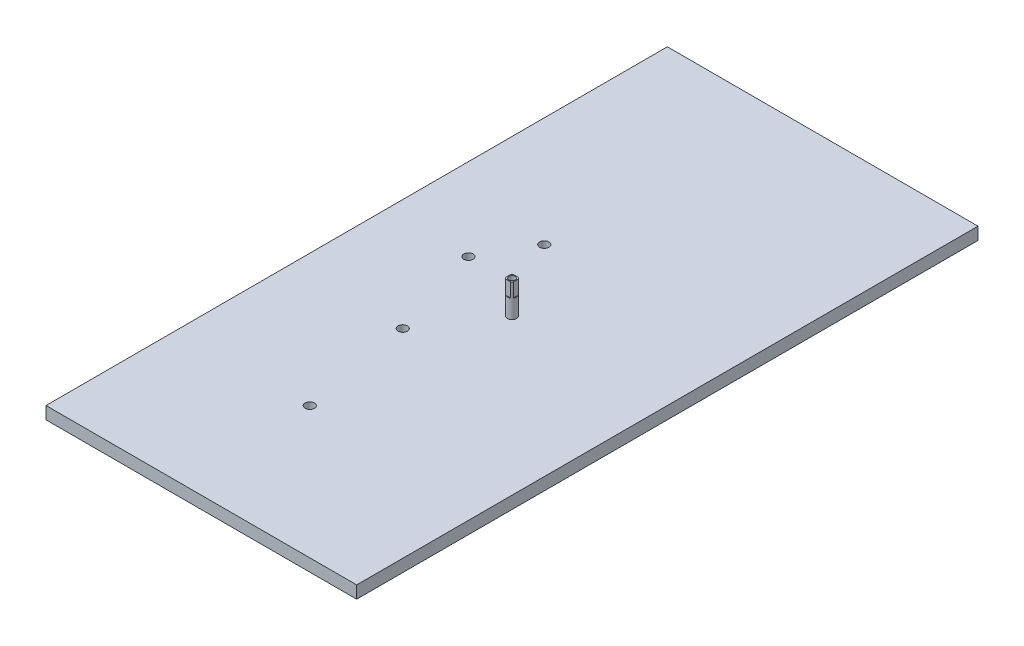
ISO-10303-21;
HEADER;
FILE_DESCRIPTION(('STEP AP214'),'2;1');
FILE_NAME('part.step','',(''),(''),'','','');
FILE_SCHEMA(('AUTOMOTIVE_DESIGN { 1 0 10303 214 1 1 1 1 }'));
ENDSEC;
DATA;
#1=APPLICATION_CONTEXT('core data for automotive mechanical design processes');
#2=APPLICATION_PROTOCOL_DEFINITION('international standard','automotive_design',2000,#1);
#3=PRODUCT_CONTEXT('',#1,'mechanical');
#4=PRODUCT('Part','Part','',(#3));
#5=PRODUCT_RELATED_PRODUCT_CATEGORY('part','',(#4));
#6=PRODUCT_DEFINITION_FORMATION('','',#4);
#7=PRODUCT_DEFINITION_CONTEXT('part definition',#1,'design');
#8=PRODUCT_DEFINITION('design','',#6,#7);
#9=PRODUCT_DEFINITION_SHAPE('','',#8);
#10=(LENGTH_UNIT() NAMED_UNIT(*) SI_UNIT(.MILLI.,.METRE.));
#11=(NAMED_UNIT(*) PLANE_ANGLE_UNIT() SI_UNIT($,.RADIAN.));
#12=(NAMED_UNIT(*) SI_UNIT($,.STERADIAN.) SOLID_ANGLE_UNIT());
#13=UNCERTAINTY_MEASURE_WITH_UNIT(LENGTH_MEASURE(1.E-05),#10,'distance_accuracy_value','');
#14=(GEOMETRIC_REPRESENTATION_CONTEXT(3) GLOBAL_UNCERTAINTY_ASSIGNED_CONTEXT((#13)) GLOBAL_UNIT_ASSIGNED_CONTEXT((#10,
#11,#12)) REPRESENTATION_CONTEXT('',''));
#15=CARTESIAN_POINT('',(0.,0.,0.));
#16=DIRECTION('',(0.,0.,1.));
#17=DIRECTION('',(1.,0.,0.));
#18=AXIS2_PLACEMENT_3D('',#15,#16,#17);
#19=CARTESIAN_POINT('',(0.,14.5,0.));
#20=DIRECTION('',(0.,1.,0.));
#21=DIRECTION('',(0.,0.,1.));
#22=AXIS2_PLACEMENT_3D('',#19,#20,#21);
#23=PLANE('',#22);
#24=CARTESIAN_POINT('',(0.,14.5,0.));
#25=DIRECTION('',(0.,1.,0.));
#26=DIRECTION('',(0.,0.,1.));
#27=AXIS2_PLACEMENT_3D('',#24,#25,#26);
#28=CIRCLE('',#27,1.);
#29=CARTESIAN_POINT('',(0.,14.5,1.));
#30=VERTEX_POINT('',#29);
#31=EDGE_CURVE('E148',#30,#30,#28,.T.);
#32=ORIENTED_EDGE('',*,*,#31,.F.);
#33=EDGE_LOOP('',(#32));
#34=FACE_BOUND('',#33,.T.);
#35=CARTESIAN_POINT('',(0.,14.5,0.));
#36=DIRECTION('',(0.,1.,0.));
#37=DIRECTION('',(0.,0.,1.));
#38=AXIS2_PLACEMENT_3D('',#35,#36,#37);
#39=CIRCLE('',#38,1.5);
#40=CARTESIAN_POINT('',(-0.829156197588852,14.5,-1.25));
#41=VERTEX_POINT('',#40);
#42=CARTESIAN_POINT('',(-1.25,14.5,-0.82915619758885));
#43=VERTEX_POINT('',#42);
#44=EDGE_CURVE('E147',#41,#43,#39,.T.);
#45=ORIENTED_EDGE('',*,*,#44,.T.);
#46=DIRECTION('',(0.,0.,1.));
#47=VECTOR('',#46,1.);
#48=CARTESIAN_POINT('',(-1.25,14.5,-1.25));
#49=LINE('',#48,#47);
#50=CARTESIAN_POINT('',(-1.25,14.5,0.82915619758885));
#51=VERTEX_POINT('',#50);
#52=EDGE_CURVE('E132',#43,#51,#49,.T.);
#53=ORIENTED_EDGE('',*,*,#52,.T.);
#54=CARTESIAN_POINT('',(-0.82915619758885,14.5,1.25));
#55=VERTEX_POINT('',#54);
#56=EDGE_CURVE('E140',#51,#55,#39,.T.);
#57=ORIENTED_EDGE('',*,*,#56,.T.);
#58=DIRECTION('',(1.,0.,0.));
#59=VECTOR('',#58,1.);
#60=CARTESIAN_POINT('',(1.25,14.5,1.25));
#61=LINE('',#60,#59);
#62=CARTESIAN_POINT('',(0.82915619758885,14.5,1.25));
#63=VERTEX_POINT('',#62);
#64=EDGE_CURVE('E120',#55,#63,#61,.T.);
#65=ORIENTED_EDGE('',*,*,#64,.T.);
#66=CARTESIAN_POINT('',(1.25,14.5,0.829156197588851));
#67=VERTEX_POINT('',#66);
#68=EDGE_CURVE('E150',#63,#67,#39,.T.);
#69=ORIENTED_EDGE('',*,*,#68,.T.);
#70=DIRECTION('',(0.,0.,-1.));
#71=VECTOR('',#70,1.);
#72=CARTESIAN_POINT('',(1.25,14.5,-1.25));
#73=LINE('',#72,#71);
#74=CARTESIAN_POINT('',(1.25,14.5,-0.829156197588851));
#75=VERTEX_POINT('',#74);
#76=EDGE_CURVE('E131',#67,#75,#73,.T.);
#77=ORIENTED_EDGE('',*,*,#76,.T.);
#78=CARTESIAN_POINT('',(0.829156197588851,14.5,-1.25));
#79=VERTEX_POINT('',#78);
#80=EDGE_CURVE('E151',#75,#79,#39,.T.);
#81=ORIENTED_EDGE('',*,*,#80,.T.);
#82=DIRECTION('',(-1.,0.,0.));
#83=VECTOR('',#82,1.);
#84=CARTESIAN_POINT('',(1.25,14.5,-1.25));
#85=LINE('',#84,#83);
#86=EDGE_CURVE('E162',#79,#41,#85,.T.);
#87=ORIENTED_EDGE('',*,*,#86,.T.);
#88=EDGE_LOOP('',(#45,#53,#57,#65,#69,#77,#81,#87));
#89=FACE_BOUND('',#88,.T.);
#90=ADVANCED_FACE('F33',(#34,#89),#23,.T.);
#91=CARTESIAN_POINT('',(0.,14.5,0.));
#92=DIRECTION('',(0.,-1.,0.));
#93=DIRECTION('',(0.,0.,-1.));
#94=AXIS2_PLACEMENT_3D('',#91,#92,#93);
#95=CYLINDRICAL_SURFACE('',#94,1.5);
#96=CARTESIAN_POINT('',(0.,4.,0.));
#97=DIRECTION('',(0.,-1.,0.));
#98=DIRECTION('',(0.,0.,-1.));
#99=AXIS2_PLACEMENT_3D('',#96,#97,#98);
#100=CIRCLE('',#99,1.5);
#101=CARTESIAN_POINT('',(0.,4.,-1.5));
#102=VERTEX_POINT('',#101);
#103=EDGE_CURVE('E182',#102,#102,#100,.F.);
#104=ORIENTED_EDGE('',*,*,#103,.T.);
#105=EDGE_LOOP('',(#104));
#106=FACE_BOUND('',#105,.T.);
#107=DIRECTION('',(0.,-1.,0.));
#108=VECTOR('',#107,1.);
#109=CARTESIAN_POINT('',(-1.25,14.5,-0.82915619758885));
#110=LINE('',#109,#108);
#111=CARTESIAN_POINT('',(-1.25,10.,-0.82915619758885));
#112=VERTEX_POINT('',#111);
#113=EDGE_CURVE('E11',#43,#112,#110,.T.);
#114=ORIENTED_EDGE('',*,*,#113,.F.);
#115=ORIENTED_EDGE('',*,*,#44,.F.);
#116=DIRECTION('',(0.,-1.,0.));
#117=VECTOR('',#116,1.);
#118=CARTESIAN_POINT('',(-0.829156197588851,14.5,-1.25));
#119=LINE('',#118,#117);
#120=CARTESIAN_POINT('',(-0.829156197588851,10.,-1.25));
#121=VERTEX_POINT('',#120);
#122=EDGE_CURVE('E173',#121,#41,#119,.F.);
#123=ORIENTED_EDGE('',*,*,#122,.F.);
#124=CARTESIAN_POINT('',(0.,10.,0.));
#125=DIRECTION('',(0.,-1.,0.));
#126=DIRECTION('',(0.,0.,-1.));
#127=AXIS2_PLACEMENT_3D('',#124,#125,#126);
#128=CIRCLE('',#127,1.5);
#129=CARTESIAN_POINT('',(0.829156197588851,10.,-1.25));
#130=VERTEX_POINT('',#129);
#131=EDGE_CURVE('E170',#121,#130,#128,.T.);
#132=ORIENTED_EDGE('',*,*,#131,.T.);
#133=DIRECTION('',(0.,-1.,0.));
#134=VECTOR('',#133,1.);
#135=CARTESIAN_POINT('',(0.829156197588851,14.5,-1.25));
#136=LINE('',#135,#134);
#137=EDGE_CURVE('E168',#79,#130,#136,.T.);
#138=ORIENTED_EDGE('',*,*,#137,.F.);
#139=ORIENTED_EDGE('',*,*,#80,.F.);
#140=DIRECTION('',(0.,-1.,0.));
#141=VECTOR('',#140,1.);
#142=CARTESIAN_POINT('',(1.25,14.5,-0.829156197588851));
#143=LINE('',#142,#141);
#144=CARTESIAN_POINT('',(1.25,10.,-0.829156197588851));
#145=VERTEX_POINT('',#144);
#146=EDGE_CURVE('E143',#145,#75,#143,.F.);
#147=ORIENTED_EDGE('',*,*,#146,.F.);
#148=CARTESIAN_POINT('',(1.25,10.,0.829156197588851));
#149=VERTEX_POINT('',#148);
#150=EDGE_CURVE('E175',#145,#149,#128,.T.);
#151=ORIENTED_EDGE('',*,*,#150,.T.);
#152=DIRECTION('',(0.,-1.,0.));
#153=VECTOR('',#152,1.);
#154=CARTESIAN_POINT('',(1.25,14.5,0.829156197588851));
#155=LINE('',#154,#153);
#156=EDGE_CURVE('E178',#67,#149,#155,.T.);
#157=ORIENTED_EDGE('',*,*,#156,.F.);
#158=ORIENTED_EDGE('',*,*,#68,.F.);
#159=DIRECTION('',(0.,-1.,0.));
#160=VECTOR('',#159,1.);
#161=CARTESIAN_POINT('',(0.82915619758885,14.5,1.25));
#162=LINE('',#161,#160);
#163=CARTESIAN_POINT('',(0.82915619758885,10.,1.25));
#164=VERTEX_POINT('',#163);
#165=EDGE_CURVE('E126',#164,#63,#162,.F.);
#166=ORIENTED_EDGE('',*,*,#165,.F.);
#167=CARTESIAN_POINT('',(-0.82915619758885,10.,1.25));
#168=VERTEX_POINT('',#167);
#169=EDGE_CURVE('E142',#164,#168,#128,.T.);
#170=ORIENTED_EDGE('',*,*,#169,.T.);
#171=DIRECTION('',(0.,-1.,0.));
#172=VECTOR('',#171,1.);
#173=CARTESIAN_POINT('',(-0.82915619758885,14.5,1.25));
#174=LINE('',#173,#172);
#175=EDGE_CURVE('E123',#55,#168,#174,.T.);
#176=ORIENTED_EDGE('',*,*,#175,.F.);
#177=ORIENTED_EDGE('',*,*,#56,.F.);
#178=DIRECTION('',(0.,-1.,0.));
#179=VECTOR('',#178,1.);
#180=CARTESIAN_POINT('',(-1.25,14.5,0.82915619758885));
#181=LINE('',#180,#179);
#182=CARTESIAN_POINT('',(-1.25,10.,0.82915619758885));
#183=VERTEX_POINT('',#182);
#184=EDGE_CURVE('E171',#183,#51,#181,.F.);
#185=ORIENTED_EDGE('',*,*,#184,.F.);
#186=EDGE_CURVE('E41',#183,#112,#128,.T.);
#187=ORIENTED_EDGE('',*,*,#186,.T.);
#188=EDGE_LOOP('',(#114,#115,#123,#132,#138,#139,#147,#151,#157,#158,#166,#170,#176,#177,#185,#187));
#189=FACE_BOUND('',#188,.T.);
#190=ADVANCED_FACE('F138',(#106,#189),#95,.T.);
#191=CARTESIAN_POINT('',(0.,4.,0.));
#192=DIRECTION('',(0.,-1.,0.));
#193=DIRECTION('',(0.,0.,-1.));
#194=AXIS2_PLACEMENT_3D('',#191,#192,#193);
#195=PLANE('',#194);
#196=DIRECTION('',(0.,0.,-1.));
#197=VECTOR('',#196,1.);
#198=CARTESIAN_POINT('',(50.,4.,100.));
#199=LINE('',#198,#197);
#200=CARTESIAN_POINT('',(50.,4.,100.));
#201=VERTEX_POINT('',#200);
#202=CARTESIAN_POINT('',(50.,4.,-100.));
#203=VERTEX_POINT('',#202);
#204=EDGE_CURVE('E200',#201,#203,#199,.T.);
#205=ORIENTED_EDGE('',*,*,#204,.T.);
#206=DIRECTION('',(-1.,0.,0.));
#207=VECTOR('',#206,1.);
#208=CARTESIAN_POINT('',(-50.,4.,-100.));
#209=LINE('',#208,#207);
#210=CARTESIAN_POINT('',(-50.,4.,-100.));
#211=VERTEX_POINT('',#210);
#212=EDGE_CURVE('E212',#203,#211,#209,.T.);
#213=ORIENTED_EDGE('',*,*,#212,.T.);
#214=DIRECTION('',(0.,0.,1.));
#215=VECTOR('',#214,1.);
#216=CARTESIAN_POINT('',(-50.,4.,100.));
#217=LINE('',#216,#215);
#218=CARTESIAN_POINT('',(-50.,4.,100.));
#219=VERTEX_POINT('',#218);
#220=EDGE_CURVE('E210',#211,#219,#217,.T.);
#221=ORIENTED_EDGE('',*,*,#220,.T.);
#222=DIRECTION('',(1.,0.,0.));
#223=VECTOR('',#222,1.);
#224=CARTESIAN_POINT('',(-50.,4.,100.));
#225=LINE('',#224,#223);
#226=EDGE_CURVE('E197',#219,#201,#225,.T.);
#227=ORIENTED_EDGE('',*,*,#226,.T.);
#228=EDGE_LOOP('',(#205,#213,#221,#227));
#229=FACE_BOUND('',#228,.T.);
#230=CARTESIAN_POINT('',(-14.666351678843,4.,-25.0632547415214));
#231=DIRECTION('',(0.,1.,0.));
#232=DIRECTION('',(0.,0.,1.));
#233=AXIS2_PLACEMENT_3D('',#230,#231,#232);
#234=CIRCLE('',#233,1.5);
#235=CARTESIAN_POINT('',(-14.666351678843,4.,-23.5632547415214));
#236=VERTEX_POINT('',#235);
#237=EDGE_CURVE('E275',#236,#236,#234,.T.);
#238=ORIENTED_EDGE('',*,*,#237,.F.);
#239=EDGE_LOOP('',(#238));
#240=FACE_BOUND('',#239,.T.);
#241=CARTESIAN_POINT('',(-23.5191286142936,4.,-9.5));
#242=DIRECTION('',(0.,1.,0.));
#243=DIRECTION('',(0.,0.,1.));
#244=AXIS2_PLACEMENT_3D('',#241,#242,#243);
#245=CIRCLE('',#244,1.5);
#246=CARTESIAN_POINT('',(-23.5191286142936,4.,-8.));
#247=VERTEX_POINT('',#246);
#248=EDGE_CURVE('E279',#247,#247,#245,.T.);
#249=ORIENTED_EDGE('',*,*,#248,.F.);
#250=EDGE_LOOP('',(#249));
#251=FACE_BOUND('',#250,.T.);
#252=CARTESIAN_POINT('',(-14.044290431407,4.,21.1224363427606));
#253=DIRECTION('',(0.,1.,0.));
#254=DIRECTION('',(0.,0.,1.));
#255=AXIS2_PLACEMENT_3D('',#252,#253,#254);
#256=CIRCLE('',#255,1.5);
#257=CARTESIAN_POINT('',(-14.044290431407,4.,22.6224363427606));
#258=VERTEX_POINT('',#257);
#259=EDGE_CURVE('E285',#258,#258,#256,.T.);
#260=ORIENTED_EDGE('',*,*,#259,.F.);
#261=EDGE_LOOP('',(#260));
#262=FACE_BOUND('',#261,.T.);
#263=CARTESIAN_POINT('',(-7.49755196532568,4.,57.5927572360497));
#264=DIRECTION('',(0.,1.,0.));
#265=DIRECTION('',(0.,0.,1.));
#266=AXIS2_PLACEMENT_3D('',#263,#264,#265);
#267=CIRCLE('',#266,1.5);
#268=CARTESIAN_POINT('',(-7.49755196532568,4.,59.0927572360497));
#269=VERTEX_POINT('',#268);
#270=EDGE_CURVE('E158',#269,#269,#267,.T.);
#271=ORIENTED_EDGE('',*,*,#270,.F.);
#272=EDGE_LOOP('',(#271));
#273=FACE_BOUND('',#272,.T.);
#274=ORIENTED_EDGE('',*,*,#103,.F.);
#275=EDGE_LOOP('',(#274));
#276=FACE_BOUND('',#275,.T.);
#277=ADVANCED_FACE('F296',(#229,#240,#251,#262,#273,#276),#195,.F.);
#278=CARTESIAN_POINT('',(0.,0.,0.));
#279=DIRECTION('',(0.,-1.,0.));
#280=DIRECTION('',(0.,0.,-1.));
#281=AXIS2_PLACEMENT_3D('',#278,#279,#280);
#282=PLANE('',#281);
#283=CARTESIAN_POINT('',(0.,0.,0.));
#284=DIRECTION('',(0.,-1.,0.));
#285=DIRECTION('',(0.,0.,-1.));
#286=AXIS2_PLACEMENT_3D('',#283,#284,#285);
#287=CIRCLE('',#286,1.);
#288=CARTESIAN_POINT('',(0.,0.,-1.));
#289=VERTEX_POINT('',#288);
#290=EDGE_CURVE('E155',#289,#289,#287,.F.);
#291=ORIENTED_EDGE('',*,*,#290,.T.);
#292=EDGE_LOOP('',(#291));
#293=FACE_BOUND('',#292,.T.);
#294=CARTESIAN_POINT('',(-21.5,0.,72.75));
#295=DIRECTION('',(0.,1.,0.));
#296=DIRECTION('',(0.,0.,1.));
#297=AXIS2_PLACEMENT_3D('',#294,#295,#296);
#298=CIRCLE('',#297,1.5);
#299=CARTESIAN_POINT('',(-21.5,0.,74.25));
#300=VERTEX_POINT('',#299);
#301=EDGE_CURVE('E267',#300,#300,#298,.T.);
#302=ORIENTED_EDGE('',*,*,#301,.T.);
#303=EDGE_LOOP('',(#302));
#304=FACE_BOUND('',#303,.T.);
#305=CARTESIAN_POINT('',(-11.3842353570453,0.,87.5235528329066));
#306=DIRECTION('',(0.,1.,0.));
#307=DIRECTION('',(0.,0.,1.));
#308=AXIS2_PLACEMENT_3D('',#305,#306,#307);
#309=CIRCLE('',#308,1.5);
#310=CARTESIAN_POINT('',(-11.3842353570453,0.,89.0235528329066));
#311=VERTEX_POINT('',#310);
#312=EDGE_CURVE('E255',#311,#311,#309,.T.);
#313=ORIENTED_EDGE('',*,*,#312,.T.);
#314=EDGE_LOOP('',(#313));
#315=FACE_BOUND('',#314,.T.);
#316=CARTESIAN_POINT('',(-7.49755196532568,0.,57.5927572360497));
#317=DIRECTION('',(0.,1.,0.));
#318=DIRECTION('',(0.,0.,1.));
#319=AXIS2_PLACEMENT_3D('',#316,#317,#318);
#320=CIRCLE('',#319,1.5);
#321=CARTESIAN_POINT('',(-7.49755196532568,0.,59.0927572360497));
#322=VERTEX_POINT('',#321);
#323=EDGE_CURVE('E243',#322,#322,#320,.T.);
#324=ORIENTED_EDGE('',*,*,#323,.T.);
#325=EDGE_LOOP('',(#324));
#326=FACE_BOUND('',#325,.T.);
#327=CARTESIAN_POINT('',(15.3263309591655,0.,-85.434220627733));
#328=DIRECTION('',(0.,1.,0.));
#329=DIRECTION('',(0.,0.,1.));
#330=AXIS2_PLACEMENT_3D('',#327,#328,#329);
#331=CIRCLE('',#330,1.5);
#332=CARTESIAN_POINT('',(15.3263309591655,0.,-83.934220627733));
#333=VERTEX_POINT('',#332);
#334=EDGE_CURVE('E234',#333,#333,#331,.T.);
#335=ORIENTED_EDGE('',*,*,#334,.T.);
#336=EDGE_LOOP('',(#335));
#337=FACE_BOUND('',#336,.T.);
#338=CARTESIAN_POINT('',(0.,0.,-72.75));
#339=DIRECTION('',(0.,1.,0.));
#340=DIRECTION('',(0.,0.,1.));
#341=AXIS2_PLACEMENT_3D('',#338,#339,#340);
#342=CIRCLE('',#341,1.5);
#343=CARTESIAN_POINT('',(0.,0.,-71.25));
#344=VERTEX_POINT('',#343);
#345=EDGE_CURVE('E222',#344,#344,#342,.T.);
#346=ORIENTED_EDGE('',*,*,#345,.T.);
#347=EDGE_LOOP('',(#346));
#348=FACE_BOUND('',#347,.T.);
#349=DIRECTION('',(0.,0.,-1.));
#350=VECTOR('',#349,1.);
#351=CARTESIAN_POINT('',(50.,0.,100.));
#352=LINE('',#351,#350);
#353=CARTESIAN_POINT('',(50.,0.,100.));
#354=VERTEX_POINT('',#353);
#355=CARTESIAN_POINT('',(50.,0.,-100.));
#356=VERTEX_POINT('',#355);
#357=EDGE_CURVE('E205',#354,#356,#352,.T.);
#358=ORIENTED_EDGE('',*,*,#357,.F.);
#359=DIRECTION('',(1.,0.,0.));
#360=VECTOR('',#359,1.);
#361=CARTESIAN_POINT('',(-50.,0.,100.));
#362=LINE('',#361,#360);
#363=CARTESIAN_POINT('',(-50.,0.,100.));
#364=VERTEX_POINT('',#363);
#365=EDGE_CURVE('E198',#364,#354,#362,.T.);
#366=ORIENTED_EDGE('',*,*,#365,.F.);
#367=DIRECTION('',(0.,0.,1.));
#368=VECTOR('',#367,1.);
#369=CARTESIAN_POINT('',(-50.,0.,100.));
#370=LINE('',#369,#368);
#371=CARTESIAN_POINT('',(-50.,0.,-100.));
#372=VERTEX_POINT('',#371);
#373=EDGE_CURVE('E201',#372,#364,#370,.T.);
#374=ORIENTED_EDGE('',*,*,#373,.F.);
#375=DIRECTION('',(-1.,0.,0.));
#376=VECTOR('',#375,1.);
#377=CARTESIAN_POINT('',(-50.,0.,-100.));
#378=LINE('',#377,#376);
#379=EDGE_CURVE('E203',#356,#372,#378,.T.);
#380=ORIENTED_EDGE('',*,*,#379,.F.);
#381=EDGE_LOOP('',(#358,#366,#374,#380));
#382=FACE_BOUND('',#381,.T.);
#383=CARTESIAN_POINT('',(16.4917016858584,0.,-59.9290132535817));
#384=DIRECTION('',(0.,1.,0.));
#385=DIRECTION('',(0.,0.,1.));
#386=AXIS2_PLACEMENT_3D('',#383,#384,#385);
#387=CIRCLE('',#386,1.5);
#388=CARTESIAN_POINT('',(16.4917016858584,0.,-58.4290132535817));
#389=VERTEX_POINT('',#388);
#390=EDGE_CURVE('E216',#389,#389,#387,.T.);
#391=ORIENTED_EDGE('',*,*,#390,.T.);
#392=EDGE_LOOP('',(#391));
#393=FACE_BOUND('',#392,.T.);
#394=CARTESIAN_POINT('',(29.,0.,-72.75));
#395=DIRECTION('',(0.,1.,0.));
#396=DIRECTION('',(0.,0.,1.));
#397=AXIS2_PLACEMENT_3D('',#394,#395,#396);
#398=CIRCLE('',#397,1.5);
#399=CARTESIAN_POINT('',(29.,0.,-71.25));
#400=VERTEX_POINT('',#399);
#401=EDGE_CURVE('E228',#400,#400,#398,.T.);
#402=ORIENTED_EDGE('',*,*,#401,.T.);
#403=EDGE_LOOP('',(#402));
#404=FACE_BOUND('',#403,.T.);
#405=CARTESIAN_POINT('',(15.9154943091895,0.,0.));
#406=DIRECTION('',(0.,1.,0.));
#407=DIRECTION('',(0.,0.,1.));
#408=AXIS2_PLACEMENT_3D('',#405,#406,#407);
#409=CIRCLE('',#408,1.);
#410=CARTESIAN_POINT('',(15.9154943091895,0.,1.));
#411=VERTEX_POINT('',#410);
#412=EDGE_CURVE('E240',#411,#411,#409,.T.);
#413=ORIENTED_EDGE('',*,*,#412,.T.);
#414=EDGE_LOOP('',(#413));
#415=FACE_BOUND('',#414,.T.);
#416=CARTESIAN_POINT('',(0.,0.,72.75));
#417=DIRECTION('',(0.,1.,0.));
#418=DIRECTION('',(0.,0.,1.));
#419=AXIS2_PLACEMENT_3D('',#416,#417,#418);
#420=CIRCLE('',#419,1.5);
#421=CARTESIAN_POINT('',(0.,0.,74.25));
#422=VERTEX_POINT('',#421);
#423=EDGE_CURVE('E249',#422,#422,#420,.T.);
#424=ORIENTED_EDGE('',*,*,#423,.T.);
#425=EDGE_LOOP('',(#424));
#426=FACE_BOUND('',#425,.T.);
#427=CARTESIAN_POINT('',(29.0955130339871,0.,72.75));
#428=DIRECTION('',(0.,1.,0.));
#429=DIRECTION('',(0.,0.,1.));
#430=AXIS2_PLACEMENT_3D('',#427,#428,#429);
#431=CIRCLE('',#430,1.5);
#432=CARTESIAN_POINT('',(29.0955130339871,0.,74.25));
#433=VERTEX_POINT('',#432);
#434=EDGE_CURVE('E261',#433,#433,#431,.T.);
#435=ORIENTED_EDGE('',*,*,#434,.T.);
#436=EDGE_LOOP('',(#435));
#437=FACE_BOUND('',#436,.T.);
#438=CARTESIAN_POINT('',(-14.666351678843,0.,-25.0632547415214));
#439=DIRECTION('',(0.,1.,0.));
#440=DIRECTION('',(0.,0.,1.));
#441=AXIS2_PLACEMENT_3D('',#438,#439,#440);
#442=CIRCLE('',#441,1.5);
#443=CARTESIAN_POINT('',(-14.666351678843,0.,-23.5632547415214));
#444=VERTEX_POINT('',#443);
#445=EDGE_CURVE('E270',#444,#444,#442,.T.);
#446=ORIENTED_EDGE('',*,*,#445,.T.);
#447=EDGE_LOOP('',(#446));
#448=FACE_BOUND('',#447,.T.);
#449=ADVANCED_FACE('F299',(#293,#304,#315,#326,#337,#348,#382,#393,#404,#415,#426,#437,#448),
#282,.T.);
#450=CARTESIAN_POINT('',(50.,4.,100.));
#451=DIRECTION('',(-1.,0.,0.));
#452=DIRECTION('',(0.,0.,1.));
#453=AXIS2_PLACEMENT_3D('',#450,#451,#452);
#454=PLANE('',#453);
#455=ORIENTED_EDGE('',*,*,#357,.T.);
#456=DIRECTION('',(0.,-1.,0.));
#457=VECTOR('',#456,1.);
#458=CARTESIAN_POINT('',(50.,4.,-100.));
#459=LINE('',#458,#457);
#460=EDGE_CURVE('E185',#203,#356,#459,.T.);
#461=ORIENTED_EDGE('',*,*,#460,.F.);
#462=ORIENTED_EDGE('',*,*,#204,.F.);
#463=DIRECTION('',(0.,-1.,0.));
#464=VECTOR('',#463,1.);
#465=CARTESIAN_POINT('',(50.,4.,100.));
#466=LINE('',#465,#464);
#467=EDGE_CURVE('E194',#201,#354,#466,.T.);
#468=ORIENTED_EDGE('',*,*,#467,.T.);
#469=EDGE_LOOP('',(#455,#461,#462,#468));
#470=FACE_BOUND('',#469,.T.);
#471=ADVANCED_FACE('F35',(#470),#454,.F.);
#472=CARTESIAN_POINT('',(-50.,4.,-100.));
#473=DIRECTION('',(0.,0.,1.));
#474=DIRECTION('',(1.,0.,0.));
#475=AXIS2_PLACEMENT_3D('',#472,#473,#474);
#476=PLANE('',#475);
#477=ORIENTED_EDGE('',*,*,#379,.T.);
#478=DIRECTION('',(0.,-1.,0.));
#479=VECTOR('',#478,1.);
#480=CARTESIAN_POINT('',(-50.,4.,-100.));
#481=LINE('',#480,#479);
#482=EDGE_CURVE('E188',#211,#372,#481,.T.);
#483=ORIENTED_EDGE('',*,*,#482,.F.);
#484=ORIENTED_EDGE('',*,*,#212,.F.);
#485=ORIENTED_EDGE('',*,*,#460,.T.);
#486=EDGE_LOOP('',(#477,#483,#484,#485));
#487=FACE_BOUND('',#486,.T.);
#488=ADVANCED_FACE('F420',(#487),#476,.F.);
#489=CARTESIAN_POINT('',(-50.,4.,100.));
#490=DIRECTION('',(1.,0.,0.));
#491=DIRECTION('',(0.,0.,-1.));
#492=AXIS2_PLACEMENT_3D('',#489,#490,#491);
#493=PLANE('',#492);
#494=ORIENTED_EDGE('',*,*,#373,.T.);
#495=DIRECTION('',(0.,-1.,0.));
#496=VECTOR('',#495,1.);
#497=CARTESIAN_POINT('',(-50.,4.,100.));
#498=LINE('',#497,#496);
#499=EDGE_CURVE('E191',#219,#364,#498,.T.);
#500=ORIENTED_EDGE('',*,*,#499,.F.);
#501=ORIENTED_EDGE('',*,*,#220,.F.);
#502=ORIENTED_EDGE('',*,*,#482,.T.);
#503=EDGE_LOOP('',(#494,#500,#501,#502));
#504=FACE_BOUND('',#503,.T.);
#505=ADVANCED_FACE('F417',(#504),#493,.F.);
#506=CARTESIAN_POINT('',(-50.,4.,100.));
#507=DIRECTION('',(0.,0.,-1.));
#508=DIRECTION('',(-1.,0.,0.));
#509=AXIS2_PLACEMENT_3D('',#506,#507,#508);
#510=PLANE('',#509);
#511=ORIENTED_EDGE('',*,*,#365,.T.);
#512=ORIENTED_EDGE('',*,*,#467,.F.);
#513=ORIENTED_EDGE('',*,*,#226,.F.);
#514=ORIENTED_EDGE('',*,*,#499,.T.);
#515=EDGE_LOOP('',(#511,#512,#513,#514));
#516=FACE_BOUND('',#515,.T.);
#517=ADVANCED_FACE('F409',(#516),#510,.F.);
#518=CARTESIAN_POINT('',(16.4917016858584,3.,-59.9290132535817));
#519=DIRECTION('',(0.,-1.,0.));
#520=DIRECTION('',(0.,0.,-1.));
#521=AXIS2_PLACEMENT_3D('',#518,#519,#520);
#522=CYLINDRICAL_SURFACE('',#521,1.5);
#523=CARTESIAN_POINT('',(16.4917016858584,3.,-59.9290132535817));
#524=DIRECTION('',(0.,1.,0.));
#525=DIRECTION('',(0.,0.,1.));
#526=AXIS2_PLACEMENT_3D('',#523,#524,#525);
#527=CIRCLE('',#526,1.5);
#528=CARTESIAN_POINT('',(16.4917016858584,3.,-58.4290132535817));
#529=VERTEX_POINT('',#528);
#530=EDGE_CURVE('E208',#529,#529,#527,.T.);
#531=ORIENTED_EDGE('',*,*,#530,.T.);
#532=EDGE_LOOP('',(#531));
#533=FACE_BOUND('',#532,.T.);
#534=ORIENTED_EDGE('',*,*,#390,.F.);
#535=EDGE_LOOP('',(#534));
#536=FACE_BOUND('',#535,.T.);
#537=ADVANCED_FACE('F406',(#533,#536),#522,.F.);
#538=CARTESIAN_POINT('',(16.4917016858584,3.,-59.9290132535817));
#539=DIRECTION('',(0.,1.,0.));
#540=DIRECTION('',(0.,0.,1.));
#541=AXIS2_PLACEMENT_3D('',#538,#539,#540);
#542=PLANE('',#541);
#543=ORIENTED_EDGE('',*,*,#530,.F.);
#544=EDGE_LOOP('',(#543));
#545=FACE_BOUND('',#544,.T.);
#546=ADVANCED_FACE('F402',(#545),#542,.F.);
#547=CARTESIAN_POINT('',(0.,3.,-72.75));
#548=DIRECTION('',(0.,-1.,0.));
#549=DIRECTION('',(0.,0.,-1.));
#550=AXIS2_PLACEMENT_3D('',#547,#548,#549);
#551=CYLINDRICAL_SURFACE('',#550,1.5);
#552=CARTESIAN_POINT('',(0.,3.,-72.75));
#553=DIRECTION('',(0.,1.,0.));
#554=DIRECTION('',(0.,0.,1.));
#555=AXIS2_PLACEMENT_3D('',#552,#553,#554);
#556=CIRCLE('',#555,1.5);
#557=CARTESIAN_POINT('',(0.,3.,-71.25));
#558=VERTEX_POINT('',#557);
#559=EDGE_CURVE('E219',#558,#558,#556,.T.);
#560=ORIENTED_EDGE('',*,*,#559,.T.);
#561=EDGE_LOOP('',(#560));
#562=FACE_BOUND('',#561,.T.);
#563=ORIENTED_EDGE('',*,*,#345,.F.);
#564=EDGE_LOOP('',(#563));
#565=FACE_BOUND('',#564,.T.);
#566=ADVANCED_FACE('F398',(#562,#565),#551,.F.);
#567=CARTESIAN_POINT('',(0.,3.,-72.75));
#568=DIRECTION('',(0.,1.,0.));
#569=DIRECTION('',(0.,0.,1.));
#570=AXIS2_PLACEMENT_3D('',#567,#568,#569);
#571=PLANE('',#570);
#572=ORIENTED_EDGE('',*,*,#559,.F.);
#573=EDGE_LOOP('',(#572));
#574=FACE_BOUND('',#573,.T.);
#575=ADVANCED_FACE('F394',(#574),#571,.F.);
#576=CARTESIAN_POINT('',(29.,3.,-72.75));
#577=DIRECTION('',(0.,-1.,0.));
#578=DIRECTION('',(0.,0.,-1.));
#579=AXIS2_PLACEMENT_3D('',#576,#577,#578);
#580=CYLINDRICAL_SURFACE('',#579,1.5);
#581=CARTESIAN_POINT('',(29.,3.,-72.75));
#582=DIRECTION('',(0.,1.,0.));
#583=DIRECTION('',(0.,0.,1.));
#584=AXIS2_PLACEMENT_3D('',#581,#582,#583);
#585=CIRCLE('',#584,1.5);
#586=CARTESIAN_POINT('',(29.,3.,-71.25));
#587=VERTEX_POINT('',#586);
#588=EDGE_CURVE('E225',#587,#587,#585,.T.);
#589=ORIENTED_EDGE('',*,*,#588,.T.);
#590=EDGE_LOOP('',(#589));
#591=FACE_BOUND('',#590,.T.);
#592=ORIENTED_EDGE('',*,*,#401,.F.);
#593=EDGE_LOOP('',(#592));
#594=FACE_BOUND('',#593,.T.);
#595=ADVANCED_FACE('F390',(#591,#594),#580,.F.);
#596=CARTESIAN_POINT('',(29.,3.,-72.75));
#597=DIRECTION('',(0.,1.,0.));
#598=DIRECTION('',(0.,0.,1.));
#599=AXIS2_PLACEMENT_3D('',#596,#597,#598);
#600=PLANE('',#599);
#601=ORIENTED_EDGE('',*,*,#588,.F.);
#602=EDGE_LOOP('',(#601));
#603=FACE_BOUND('',#602,.T.);
#604=ADVANCED_FACE('F386',(#603),#600,.F.);
#605=CARTESIAN_POINT('',(15.3263309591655,3.,-85.434220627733));
#606=DIRECTION('',(0.,-1.,0.));
#607=DIRECTION('',(0.,0.,-1.));
#608=AXIS2_PLACEMENT_3D('',#605,#606,#607);
#609=CYLINDRICAL_SURFACE('',#608,1.5);
#610=CARTESIAN_POINT('',(15.3263309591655,3.,-85.434220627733));
#611=DIRECTION('',(0.,1.,0.));
#612=DIRECTION('',(0.,0.,1.));
#613=AXIS2_PLACEMENT_3D('',#610,#611,#612);
#614=CIRCLE('',#613,1.5);
#615=CARTESIAN_POINT('',(15.3263309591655,3.,-83.934220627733));
#616=VERTEX_POINT('',#615);
#617=EDGE_CURVE('E231',#616,#616,#614,.T.);
#618=ORIENTED_EDGE('',*,*,#617,.T.);
#619=EDGE_LOOP('',(#618));
#620=FACE_BOUND('',#619,.T.);
#621=ORIENTED_EDGE('',*,*,#334,.F.);
#622=EDGE_LOOP('',(#621));
#623=FACE_BOUND('',#622,.T.);
#624=ADVANCED_FACE('F382',(#620,#623),#609,.F.);
#625=CARTESIAN_POINT('',(15.3263309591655,3.,-85.434220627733));
#626=DIRECTION('',(0.,1.,0.));
#627=DIRECTION('',(0.,0.,1.));
#628=AXIS2_PLACEMENT_3D('',#625,#626,#627);
#629=PLANE('',#628);
#630=ORIENTED_EDGE('',*,*,#617,.F.);
#631=EDGE_LOOP('',(#630));
#632=FACE_BOUND('',#631,.T.);
#633=ADVANCED_FACE('F378',(#632),#629,.F.);
#634=CARTESIAN_POINT('',(15.9154943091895,3.,0.));
#635=DIRECTION('',(0.,-1.,0.));
#636=DIRECTION('',(0.,0.,-1.));
#637=AXIS2_PLACEMENT_3D('',#634,#635,#636);
#638=CYLINDRICAL_SURFACE('',#637,1.);
#639=CARTESIAN_POINT('',(15.9154943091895,3.,0.));
#640=DIRECTION('',(0.,1.,0.));
#641=DIRECTION('',(0.,0.,1.));
#642=AXIS2_PLACEMENT_3D('',#639,#640,#641);
#643=CIRCLE('',#642,1.);
#644=CARTESIAN_POINT('',(15.9154943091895,3.,1.));
#645=VERTEX_POINT('',#644);
#646=EDGE_CURVE('E237',#645,#645,#643,.T.);
#647=ORIENTED_EDGE('',*,*,#646,.T.);
#648=EDGE_LOOP('',(#647));
#649=FACE_BOUND('',#648,.T.);
#650=ORIENTED_EDGE('',*,*,#412,.F.);
#651=EDGE_LOOP('',(#650));
#652=FACE_BOUND('',#651,.T.);
#653=ADVANCED_FACE('F374',(#649,#652),#638,.F.);
#654=CARTESIAN_POINT('',(15.9154943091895,3.,0.));
#655=DIRECTION('',(0.,1.,0.));
#656=DIRECTION('',(0.,0.,1.));
#657=AXIS2_PLACEMENT_3D('',#654,#655,#656);
#658=PLANE('',#657);
#659=ORIENTED_EDGE('',*,*,#646,.F.);
#660=EDGE_LOOP('',(#659));
#661=FACE_BOUND('',#660,.T.);
#662=ADVANCED_FACE('F371',(#661),#658,.F.);
#663=CARTESIAN_POINT('',(-7.49755196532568,3.,57.5927572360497));
#664=DIRECTION('',(0.,-1.,0.));
#665=DIRECTION('',(0.,0.,-1.));
#666=AXIS2_PLACEMENT_3D('',#663,#664,#665);
#667=CYLINDRICAL_SURFACE('',#666,1.5);
#668=ORIENTED_EDGE('',*,*,#270,.T.);
#669=EDGE_LOOP('',(#668));
#670=FACE_BOUND('',#669,.T.);
#671=ORIENTED_EDGE('',*,*,#323,.F.);
#672=EDGE_LOOP('',(#671));
#673=FACE_BOUND('',#672,.T.);
#674=ADVANCED_FACE('F293',(#670,#673),#667,.F.);
#675=CARTESIAN_POINT('',(0.,3.,72.75));
#676=DIRECTION('',(0.,-1.,0.));
#677=DIRECTION('',(0.,0.,-1.));
#678=AXIS2_PLACEMENT_3D('',#675,#676,#677);
#679=CYLINDRICAL_SURFACE('',#678,1.5);
#680=CARTESIAN_POINT('',(0.,3.,72.75));
#681=DIRECTION('',(0.,1.,0.));
#682=DIRECTION('',(0.,0.,1.));
#683=AXIS2_PLACEMENT_3D('',#680,#681,#682);
#684=CIRCLE('',#683,1.5);
#685=CARTESIAN_POINT('',(0.,3.,74.25));
#686=VERTEX_POINT('',#685);
#687=EDGE_CURVE('E248',#686,#686,#684,.T.);
#688=ORIENTED_EDGE('',*,*,#687,.T.);
#689=EDGE_LOOP('',(#688));
#690=FACE_BOUND('',#689,.T.);
#691=ORIENTED_EDGE('',*,*,#423,.F.);
#692=EDGE_LOOP('',(#691));
#693=FACE_BOUND('',#692,.T.);
#694=ADVANCED_FACE('F364',(#690,#693),#679,.F.);
#695=CARTESIAN_POINT('',(0.,3.,72.75));
#696=DIRECTION('',(0.,1.,0.));
#697=DIRECTION('',(0.,0.,1.));
#698=AXIS2_PLACEMENT_3D('',#695,#696,#697);
#699=PLANE('',#698);
#700=ORIENTED_EDGE('',*,*,#687,.F.);
#701=EDGE_LOOP('',(#700));
#702=FACE_BOUND('',#701,.T.);
#703=ADVANCED_FACE('F360',(#702),#699,.F.);
#704=CARTESIAN_POINT('',(-11.3842353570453,3.,87.5235528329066));
#705=DIRECTION('',(0.,-1.,0.));
#706=DIRECTION('',(0.,0.,-1.));
#707=AXIS2_PLACEMENT_3D('',#704,#705,#706);
#708=CYLINDRICAL_SURFACE('',#707,1.5);
#709=CARTESIAN_POINT('',(-11.3842353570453,3.,87.5235528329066));
#710=DIRECTION('',(0.,1.,0.));
#711=DIRECTION('',(0.,0.,1.));
#712=AXIS2_PLACEMENT_3D('',#709,#710,#711);
#713=CIRCLE('',#712,1.5);
#714=CARTESIAN_POINT('',(-11.3842353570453,3.,89.0235528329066));
#715=VERTEX_POINT('',#714);
#716=EDGE_CURVE('E252',#715,#715,#713,.T.);
#717=ORIENTED_EDGE('',*,*,#716,.T.);
#718=EDGE_LOOP('',(#717));
#719=FACE_BOUND('',#718,.T.);
#720=ORIENTED_EDGE('',*,*,#312,.F.);
#721=EDGE_LOOP('',(#720));
#722=FACE_BOUND('',#721,.T.);
#723=ADVANCED_FACE('F356',(#719,#722),#708,.F.);
#724=CARTESIAN_POINT('',(-11.3842353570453,3.,87.5235528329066));
#725=DIRECTION('',(0.,1.,0.));
#726=DIRECTION('',(0.,0.,1.));
#727=AXIS2_PLACEMENT_3D('',#724,#725,#726);
#728=PLANE('',#727);
#729=ORIENTED_EDGE('',*,*,#716,.F.);
#730=EDGE_LOOP('',(#729));
#731=FACE_BOUND('',#730,.T.);
#732=ADVANCED_FACE('F352',(#731),#728,.F.);
#733=CARTESIAN_POINT('',(29.0955130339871,3.,72.75));
#734=DIRECTION('',(0.,-1.,0.));
#735=DIRECTION('',(0.,0.,-1.));
#736=AXIS2_PLACEMENT_3D('',#733,#734,#735);
#737=CYLINDRICAL_SURFACE('',#736,1.5);
#738=CARTESIAN_POINT('',(29.0955130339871,3.,72.75));
#739=DIRECTION('',(0.,1.,0.));
#740=DIRECTION('',(0.,0.,1.));
#741=AXIS2_PLACEMENT_3D('',#738,#739,#740);
#742=CIRCLE('',#741,1.5);
#743=CARTESIAN_POINT('',(29.0955130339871,3.,74.25));
#744=VERTEX_POINT('',#743);
#745=EDGE_CURVE('E258',#744,#744,#742,.T.);
#746=ORIENTED_EDGE('',*,*,#745,.T.);
#747=EDGE_LOOP('',(#746));
#748=FACE_BOUND('',#747,.T.);
#749=ORIENTED_EDGE('',*,*,#434,.F.);
#750=EDGE_LOOP('',(#749));
#751=FACE_BOUND('',#750,.T.);
#752=ADVANCED_FACE('F348',(#748,#751),#737,.F.);
#753=CARTESIAN_POINT('',(29.0955130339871,3.,72.75));
#754=DIRECTION('',(0.,1.,0.));
#755=DIRECTION('',(0.,0.,1.));
#756=AXIS2_PLACEMENT_3D('',#753,#754,#755);
#757=PLANE('',#756);
#758=ORIENTED_EDGE('',*,*,#745,.F.);
#759=EDGE_LOOP('',(#758));
#760=FACE_BOUND('',#759,.T.);
#761=ADVANCED_FACE('F344',(#760),#757,.F.);
#762=CARTESIAN_POINT('',(-21.5,3.,72.75));
#763=DIRECTION('',(0.,-1.,0.));
#764=DIRECTION('',(0.,0.,-1.));
#765=AXIS2_PLACEMENT_3D('',#762,#763,#764);
#766=CYLINDRICAL_SURFACE('',#765,1.5);
#767=CARTESIAN_POINT('',(-21.5,3.,72.75));
#768=DIRECTION('',(0.,1.,0.));
#769=DIRECTION('',(0.,0.,1.));
#770=AXIS2_PLACEMENT_3D('',#767,#768,#769);
#771=CIRCLE('',#770,1.5);
#772=CARTESIAN_POINT('',(-21.5,3.,74.25));
#773=VERTEX_POINT('',#772);
#774=EDGE_CURVE('E264',#773,#773,#771,.T.);
#775=ORIENTED_EDGE('',*,*,#774,.T.);
#776=EDGE_LOOP('',(#775));
#777=FACE_BOUND('',#776,.T.);
#778=ORIENTED_EDGE('',*,*,#301,.F.);
#779=EDGE_LOOP('',(#778));
#780=FACE_BOUND('',#779,.T.);
#781=ADVANCED_FACE('F340',(#777,#780),#766,.F.);
#782=CARTESIAN_POINT('',(-21.5,3.,72.75));
#783=DIRECTION('',(0.,1.,0.));
#784=DIRECTION('',(0.,0.,1.));
#785=AXIS2_PLACEMENT_3D('',#782,#783,#784);
#786=PLANE('',#785);
#787=ORIENTED_EDGE('',*,*,#774,.F.);
#788=EDGE_LOOP('',(#787));
#789=FACE_BOUND('',#788,.T.);
#790=ADVANCED_FACE('F336',(#789),#786,.F.);
#791=CARTESIAN_POINT('',(-14.666351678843,3.,-25.0632547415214));
#792=DIRECTION('',(0.,-1.,0.));
#793=DIRECTION('',(0.,0.,-1.));
#794=AXIS2_PLACEMENT_3D('',#791,#792,#793);
#795=CYLINDRICAL_SURFACE('',#794,1.5);
#796=ORIENTED_EDGE('',*,*,#237,.T.);
#797=EDGE_LOOP('',(#796));
#798=FACE_BOUND('',#797,.T.);
#799=ORIENTED_EDGE('',*,*,#445,.F.);
#800=EDGE_LOOP('',(#799));
#801=FACE_BOUND('',#800,.T.);
#802=ADVANCED_FACE('F332',(#798,#801),#795,.F.);
#803=CARTESIAN_POINT('',(-23.5191286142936,1.,-9.5));
#804=DIRECTION('',(0.,1.,0.));
#805=DIRECTION('',(0.,0.,1.));
#806=AXIS2_PLACEMENT_3D('',#803,#804,#805);
#807=CYLINDRICAL_SURFACE('',#806,1.5);
#808=CARTESIAN_POINT('',(-23.5191286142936,1.,-9.5));
#809=DIRECTION('',(0.,1.,0.));
#810=DIRECTION('',(0.,0.,1.));
#811=AXIS2_PLACEMENT_3D('',#808,#809,#810);
#812=CIRCLE('',#811,1.5);
#813=CARTESIAN_POINT('',(-23.5191286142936,1.,-8.));
#814=VERTEX_POINT('',#813);
#815=EDGE_CURVE('E278',#814,#814,#812,.T.);
#816=ORIENTED_EDGE('',*,*,#815,.F.);
#817=EDGE_LOOP('',(#816));
#818=FACE_BOUND('',#817,.T.);
#819=ORIENTED_EDGE('',*,*,#248,.T.);
#820=EDGE_LOOP('',(#819));
#821=FACE_BOUND('',#820,.T.);
#822=ADVANCED_FACE('F328',(#818,#821),#807,.F.);
#823=CARTESIAN_POINT('',(-23.5191286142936,1.,-9.5));
#824=DIRECTION('',(0.,1.,0.));
#825=DIRECTION('',(0.,0.,1.));
#826=AXIS2_PLACEMENT_3D('',#823,#824,#825);
#827=PLANE('',#826);
#828=ORIENTED_EDGE('',*,*,#815,.T.);
#829=EDGE_LOOP('',(#828));
#830=FACE_BOUND('',#829,.T.);
#831=ADVANCED_FACE('F324',(#830),#827,.T.);
#832=CARTESIAN_POINT('',(-14.044290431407,1.,21.1224363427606));
#833=DIRECTION('',(0.,1.,0.));
#834=DIRECTION('',(0.,0.,1.));
#835=AXIS2_PLACEMENT_3D('',#832,#833,#834);
#836=CYLINDRICAL_SURFACE('',#835,1.5);
#837=CARTESIAN_POINT('',(-14.044290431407,1.,21.1224363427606));
#838=DIRECTION('',(0.,1.,0.));
#839=DIRECTION('',(0.,0.,1.));
#840=AXIS2_PLACEMENT_3D('',#837,#838,#839);
#841=CIRCLE('',#840,1.5);
#842=CARTESIAN_POINT('',(-14.044290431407,1.,22.6224363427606));
#843=VERTEX_POINT('',#842);
#844=EDGE_CURVE('E282',#843,#843,#841,.T.);
#845=ORIENTED_EDGE('',*,*,#844,.F.);
#846=EDGE_LOOP('',(#845));
#847=FACE_BOUND('',#846,.T.);
#848=ORIENTED_EDGE('',*,*,#259,.T.);
#849=EDGE_LOOP('',(#848));
#850=FACE_BOUND('',#849,.T.);
#851=ADVANCED_FACE('F320',(#847,#850),#836,.F.);
#852=CARTESIAN_POINT('',(-14.044290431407,1.,21.1224363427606));
#853=DIRECTION('',(0.,1.,0.));
#854=DIRECTION('',(0.,0.,1.));
#855=AXIS2_PLACEMENT_3D('',#852,#853,#854);
#856=PLANE('',#855);
#857=ORIENTED_EDGE('',*,*,#844,.T.);
#858=EDGE_LOOP('',(#857));
#859=FACE_BOUND('',#858,.T.);
#860=ADVANCED_FACE('F316',(#859),#856,.T.);
#861=CARTESIAN_POINT('',(0.,-2.82842712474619,0.));
#862=DIRECTION('',(0.,1.,0.));
#863=DIRECTION('',(0.,0.,1.));
#864=AXIS2_PLACEMENT_3D('',#861,#862,#863);
#865=CYLINDRICAL_SURFACE('',#864,1.);
#866=ORIENTED_EDGE('',*,*,#290,.F.);
#867=EDGE_LOOP('',(#866));
#868=FACE_BOUND('',#867,.T.);
#869=ORIENTED_EDGE('',*,*,#31,.T.);
#870=EDGE_LOOP('',(#869));
#871=FACE_BOUND('',#870,.T.);
#872=ADVANCED_FACE('F313',(#868,#871),#865,.F.);
#873=CARTESIAN_POINT('',(1.25,10.,1.25));
#874=DIRECTION('',(0.,0.,1.));
#875=DIRECTION('',(1.,0.,0.));
#876=AXIS2_PLACEMENT_3D('',#873,#874,#875);
#877=PLANE('',#876);
#878=ORIENTED_EDGE('',*,*,#175,.T.);
#879=DIRECTION('',(1.,0.,0.));
#880=VECTOR('',#879,1.);
#881=CARTESIAN_POINT('',(1.25,10.,1.25));
#882=LINE('',#881,#880);
#883=EDGE_CURVE('E570',#168,#164,#882,.T.);
#884=ORIENTED_EDGE('',*,*,#883,.T.);
#885=ORIENTED_EDGE('',*,*,#165,.T.);
#886=ORIENTED_EDGE('',*,*,#64,.F.);
#887=EDGE_LOOP('',(#878,#884,#885,#886));
#888=FACE_BOUND('',#887,.T.);
#889=ADVANCED_FACE('F122',(#888),#877,.T.);
#890=CARTESIAN_POINT('',(0.,10.,0.));
#891=DIRECTION('',(0.,-1.,0.));
#892=DIRECTION('',(0.,0.,-1.));
#893=AXIS2_PLACEMENT_3D('',#890,#891,#892);
#894=PLANE('',#893);
#895=ORIENTED_EDGE('',*,*,#883,.F.);
#896=ORIENTED_EDGE('',*,*,#169,.F.);
#897=EDGE_LOOP('',(#895,#896));
#898=FACE_BOUND('',#897,.T.);
#899=ADVANCED_FACE('F502',(#898),#894,.F.);
#900=CARTESIAN_POINT('',(1.25,10.,-1.25));
#901=DIRECTION('',(1.,0.,0.));
#902=DIRECTION('',(0.,0.,-1.));
#903=AXIS2_PLACEMENT_3D('',#900,#901,#902);
#904=PLANE('',#903);
#905=ORIENTED_EDGE('',*,*,#156,.T.);
#906=DIRECTION('',(0.,0.,-1.));
#907=VECTOR('',#906,1.);
#908=CARTESIAN_POINT('',(1.25,10.,-1.25));
#909=LINE('',#908,#907);
#910=EDGE_CURVE('E572',#149,#145,#909,.T.);
#911=ORIENTED_EDGE('',*,*,#910,.T.);
#912=ORIENTED_EDGE('',*,*,#146,.T.);
#913=ORIENTED_EDGE('',*,*,#76,.F.);
#914=EDGE_LOOP('',(#905,#911,#912,#913));
#915=FACE_BOUND('',#914,.T.);
#916=ADVANCED_FACE('F511',(#915),#904,.T.);
#917=ORIENTED_EDGE('',*,*,#910,.F.);
#918=ORIENTED_EDGE('',*,*,#150,.F.);
#919=EDGE_LOOP('',(#917,#918));
#920=FACE_BOUND('',#919,.T.);
#921=ADVANCED_FACE('F514',(#920),#894,.F.);
#922=CARTESIAN_POINT('',(1.25,10.,-1.25));
#923=DIRECTION('',(0.,0.,-1.));
#924=DIRECTION('',(-1.,0.,0.));
#925=AXIS2_PLACEMENT_3D('',#922,#923,#924);
#926=PLANE('',#925);
#927=ORIENTED_EDGE('',*,*,#137,.T.);
#928=DIRECTION('',(-1.,0.,0.));
#929=VECTOR('',#928,1.);
#930=CARTESIAN_POINT('',(1.25,10.,-1.25));
#931=LINE('',#930,#929);
#932=EDGE_CURVE('E55',#130,#121,#931,.T.);
#933=ORIENTED_EDGE('',*,*,#932,.T.);
#934=ORIENTED_EDGE('',*,*,#122,.T.);
#935=ORIENTED_EDGE('',*,*,#86,.F.);
#936=EDGE_LOOP('',(#927,#933,#934,#935));
#937=FACE_BOUND('',#936,.T.);
#938=ADVANCED_FACE('F531',(#937),#926,.T.);
#939=ORIENTED_EDGE('',*,*,#932,.F.);
#940=ORIENTED_EDGE('',*,*,#131,.F.);
#941=EDGE_LOOP('',(#939,#940));
#942=FACE_BOUND('',#941,.T.);
#943=ADVANCED_FACE('F533',(#942),#894,.F.);
#944=DIRECTION('',(0.,0.,1.));
#945=VECTOR('',#944,1.);
#946=CARTESIAN_POINT('',(-1.25,10.,-1.25));
#947=LINE('',#946,#945);
#948=EDGE_CURVE('E47',#112,#183,#947,.T.);
#949=ORIENTED_EDGE('',*,*,#948,.F.);
#950=ORIENTED_EDGE('',*,*,#186,.F.);
#951=EDGE_LOOP('',(#949,#950));
#952=FACE_BOUND('',#951,.T.);
#953=ADVANCED_FACE('F513',(#952),#894,.F.);
#954=CARTESIAN_POINT('',(-1.25,10.,-1.25));
#955=DIRECTION('',(-1.,0.,0.));
#956=DIRECTION('',(0.,0.,1.));
#957=AXIS2_PLACEMENT_3D('',#954,#955,#956);
#958=PLANE('',#957);
#959=ORIENTED_EDGE('',*,*,#113,.T.);
#960=ORIENTED_EDGE('',*,*,#948,.T.);
#961=ORIENTED_EDGE('',*,*,#184,.T.);
#962=ORIENTED_EDGE('',*,*,#52,.F.);
#963=EDGE_LOOP('',(#959,#960,#961,#962));
#964=FACE_BOUND('',#963,.T.);
#965=ADVANCED_FACE('F557',(#964),#958,.T.);
#966=CLOSED_SHELL('',(#90,#190,#277,#449,#471,#488,#505,#517,#537,#546,#566,#575,#595,#604,#624,
#633,#653,#662,#674,#694,#703,#723,#732,#752,#761,#781,#790,#802,#822,#831,#851,#860,#872,#889,
#899,#916,#921,#938,#943,#953,#965));
#967=MANIFOLD_SOLID_BREP('B2',#966);
#968=ADVANCED_BREP_SHAPE_REPRESENTATION('',(#18,#967),#14);
#969=SHAPE_DEFINITION_REPRESENTATION(#9,#968);
ENDSEC;
END-ISO-10303-21;
